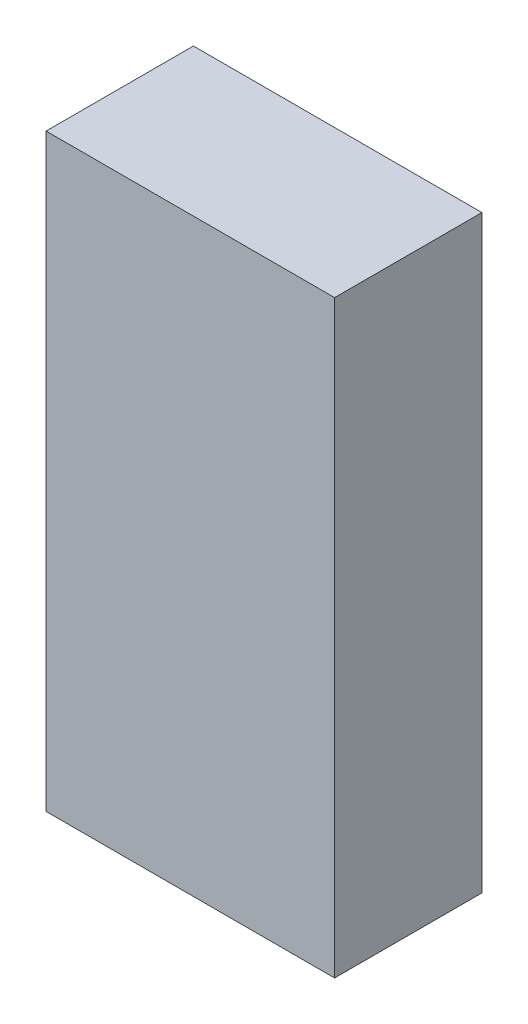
from build123d import *

# Parameters (mm, degrees)
SKETCH2_W           = 298.45
SKETCH2_H           = 609.6
BOSS_EXTRUDE1_DEPTH = 152.4


with BuildPart() as part:
    # Sketch2 → Boss-Extrude1 (new body)
    with BuildSketch(Plane.XY):
        with Locations((149.225, 304.8)):
            Rectangle(SKETCH2_W, SKETCH2_H)
    extrude(amount=BOSS_EXTRUDE1_DEPTH)


solid = part.part
